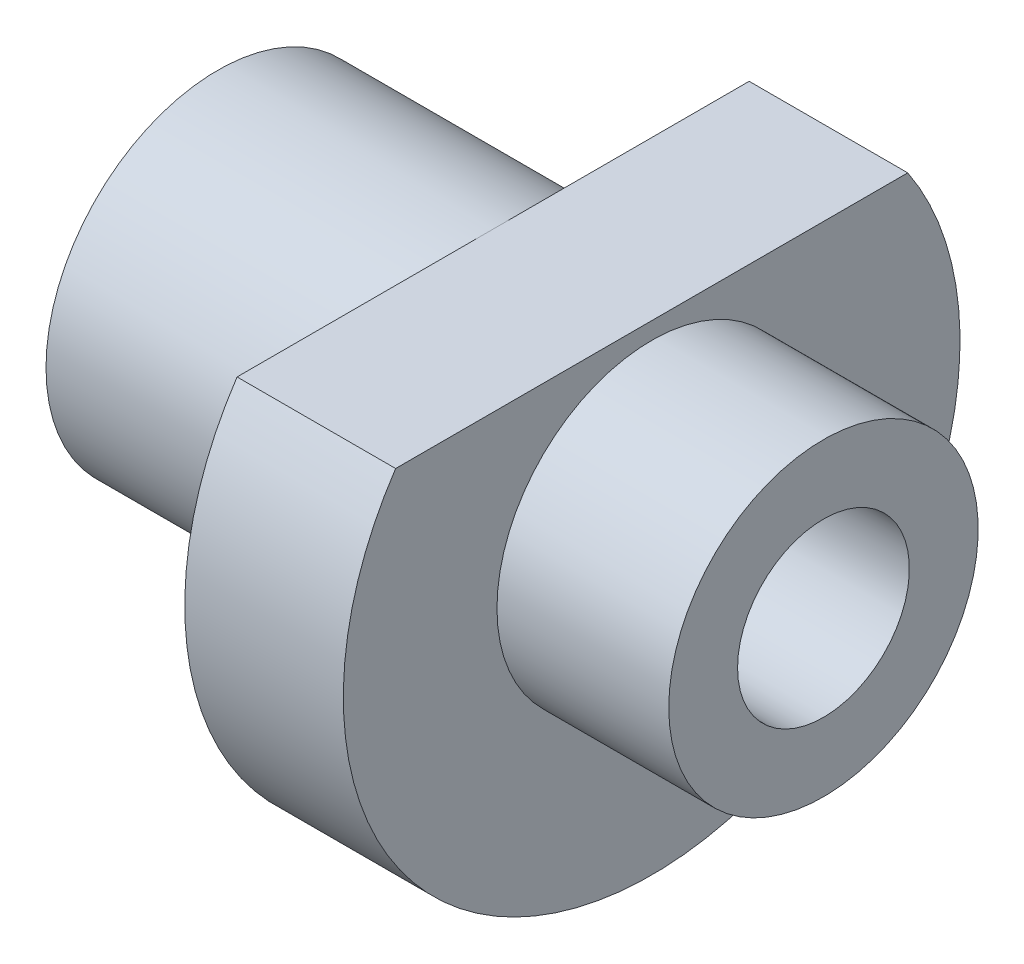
from build123d import *

# Parameters (mm, degrees)
CUT_EXTRUDE1_DEPTH = 29.37697276


with BuildPart() as part:
    # Sketch1 → Base-Revolve (revolve)
    with BuildSketch(Plane.XY, mode=Mode.PRIVATE) as base_revolve_sk:
        Polygon((0, 3.9624), (0, 7.9248), (12.7, 7.9248), (12.7, 14.224), (20.0152, 14.224), (20.0152, 7.1374), (27.94, 7.1374), (27.94, 3.9624), align=None)
    revolve(base_revolve_sk.sketch.rotate(Axis((0, 0, 0), (1, 0, 0)), 90), axis=Axis((0, 0, 0), (1, 0, 0)))

    # Sketch2 → Cut-Extrude1 (cut, through all)
    with BuildSketch(Plane(origin=(20.0152, 0, 0), x_dir=(0, 0, -1), z_dir=(1, 0, 0))):
        with BuildLine():
            Line((-11.811846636, 7.9248), (11.811846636, 7.9248))
            ThreePointArc((11.811846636, 7.9248), (0, 14.224), (-11.811846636, 7.9248))
        make_face()
    extrude(amount=-CUT_EXTRUDE1_DEPTH, mode=Mode.SUBTRACT)


solid = part.part
